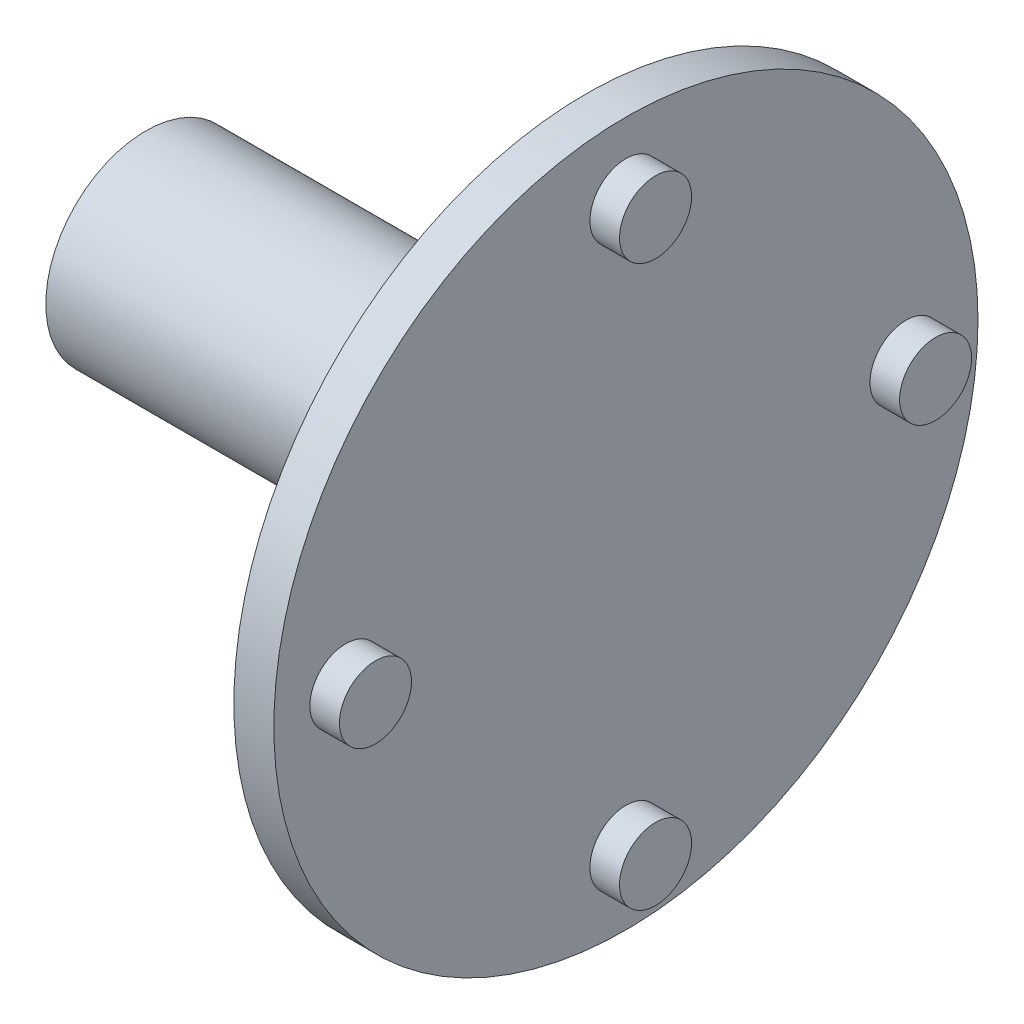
ISO-10303-21;
HEADER;
FILE_DESCRIPTION(('STEP AP214'),'2;1');
FILE_NAME('part.step','',(''),(''),'','','');
FILE_SCHEMA(('AUTOMOTIVE_DESIGN { 1 0 10303 214 1 1 1 1 }'));
ENDSEC;
DATA;
#1=APPLICATION_CONTEXT('core data for automotive mechanical design processes');
#2=APPLICATION_PROTOCOL_DEFINITION('international standard','automotive_design',2000,#1);
#3=PRODUCT_CONTEXT('',#1,'mechanical');
#4=PRODUCT('Part','Part','',(#3));
#5=PRODUCT_RELATED_PRODUCT_CATEGORY('part','',(#4));
#6=PRODUCT_DEFINITION_FORMATION('','',#4);
#7=PRODUCT_DEFINITION_CONTEXT('part definition',#1,'design');
#8=PRODUCT_DEFINITION('design','',#6,#7);
#9=PRODUCT_DEFINITION_SHAPE('','',#8);
#10=(LENGTH_UNIT() NAMED_UNIT(*) SI_UNIT(.MILLI.,.METRE.));
#11=(NAMED_UNIT(*) PLANE_ANGLE_UNIT() SI_UNIT($,.RADIAN.));
#12=(NAMED_UNIT(*) SI_UNIT($,.STERADIAN.) SOLID_ANGLE_UNIT());
#13=UNCERTAINTY_MEASURE_WITH_UNIT(LENGTH_MEASURE(1.E-05),#10,'distance_accuracy_value','');
#14=(GEOMETRIC_REPRESENTATION_CONTEXT(3) GLOBAL_UNCERTAINTY_ASSIGNED_CONTEXT((#13)) GLOBAL_UNIT_ASSIGNED_CONTEXT((#10,
#11,#12)) REPRESENTATION_CONTEXT('',''));
#15=CARTESIAN_POINT('',(0.,0.,0.));
#16=DIRECTION('',(0.,0.,1.));
#17=DIRECTION('',(1.,0.,0.));
#18=AXIS2_PLACEMENT_3D('',#15,#16,#17);
#19=CARTESIAN_POINT('',(2.,2.46546825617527E-13,35.));
#20=DIRECTION('',(-1.,0.,0.));
#21=DIRECTION('',(0.,0.,1.));
#22=AXIS2_PLACEMENT_3D('',#19,#20,#21);
#23=CYLINDRICAL_SURFACE('',#22,4.5);
#24=CARTESIAN_POINT('',(2.,2.46546825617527E-13,35.));
#25=DIRECTION('',(1.,0.,0.));
#26=DIRECTION('',(0.,0.,-1.));
#27=AXIS2_PLACEMENT_3D('',#24,#25,#26);
#28=CIRCLE('',#27,4.5);
#29=CARTESIAN_POINT('',(2.,2.46546825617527E-13,30.5));
#30=VERTEX_POINT('',#29);
#31=EDGE_CURVE('E50',#30,#30,#28,.T.);
#32=ORIENTED_EDGE('',*,*,#31,.F.);
#33=EDGE_LOOP('',(#32));
#34=FACE_BOUND('',#33,.T.);
#35=CARTESIAN_POINT('',(-2.,2.46546825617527E-13,35.));
#36=DIRECTION('',(1.,0.,0.));
#37=DIRECTION('',(0.,0.,-1.));
#38=AXIS2_PLACEMENT_3D('',#35,#36,#37);
#39=CIRCLE('',#38,4.5);
#40=CARTESIAN_POINT('',(-2.,2.46546825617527E-13,30.5));
#41=VERTEX_POINT('',#40);
#42=EDGE_CURVE('E11',#41,#41,#39,.T.);
#43=ORIENTED_EDGE('',*,*,#42,.T.);
#44=EDGE_LOOP('',(#43));
#45=FACE_BOUND('',#44,.T.);
#46=ADVANCED_FACE('F46',(#34,#45),#23,.T.);
#47=CARTESIAN_POINT('',(2.,2.46546825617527E-13,35.));
#48=DIRECTION('',(1.,0.,0.));
#49=DIRECTION('',(0.,0.,-1.));
#50=AXIS2_PLACEMENT_3D('',#47,#48,#49);
#51=PLANE('',#50);
#52=ORIENTED_EDGE('',*,*,#31,.T.);
#53=EDGE_LOOP('',(#52));
#54=FACE_BOUND('',#53,.T.);
#55=ADVANCED_FACE('F48',(#54),#51,.T.);
#56=CARTESIAN_POINT('',(-2.,2.46546825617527E-13,35.));
#57=DIRECTION('',(1.,0.,0.));
#58=DIRECTION('',(0.,0.,-1.));
#59=AXIS2_PLACEMENT_3D('',#56,#57,#58);
#60=PLANE('',#59);
#61=ORIENTED_EDGE('',*,*,#42,.F.);
#62=EDGE_LOOP('',(#61));
#63=FACE_BOUND('',#62,.T.);
#64=ADVANCED_FACE('F65',(#63),#60,.F.);
#65=CLOSED_SHELL('',(#46,#55,#64));
#66=MANIFOLD_SOLID_BREP('B2',#65);
#67=CARTESIAN_POINT('',(2.,-35.,1.24344978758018E-13));
#68=DIRECTION('',(-1.,0.,0.));
#69=DIRECTION('',(0.,0.,1.));
#70=AXIS2_PLACEMENT_3D('',#67,#68,#69);
#71=CYLINDRICAL_SURFACE('',#70,4.5);
#72=CARTESIAN_POINT('',(2.,-35.,1.24344978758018E-13));
#73=DIRECTION('',(1.,0.,0.));
#74=DIRECTION('',(0.,0.,-1.));
#75=AXIS2_PLACEMENT_3D('',#72,#73,#74);
#76=CIRCLE('',#75,4.5);
#77=CARTESIAN_POINT('',(2.,-35.,-4.49999999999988));
#78=VERTEX_POINT('',#77);
#79=EDGE_CURVE('E99',#78,#78,#76,.T.);
#80=ORIENTED_EDGE('',*,*,#79,.F.);
#81=EDGE_LOOP('',(#80));
#82=FACE_BOUND('',#81,.T.);
#83=CARTESIAN_POINT('',(-2.,-35.,1.24344978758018E-13));
#84=DIRECTION('',(1.,0.,0.));
#85=DIRECTION('',(0.,0.,-1.));
#86=AXIS2_PLACEMENT_3D('',#83,#84,#85);
#87=CIRCLE('',#86,4.5);
#88=CARTESIAN_POINT('',(-2.,-35.,-4.49999999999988));
#89=VERTEX_POINT('',#88);
#90=EDGE_CURVE('E45',#89,#89,#87,.T.);
#91=ORIENTED_EDGE('',*,*,#90,.T.);
#92=EDGE_LOOP('',(#91));
#93=FACE_BOUND('',#92,.T.);
#94=ADVANCED_FACE('F95',(#82,#93),#71,.T.);
#95=CARTESIAN_POINT('',(2.,-35.,1.24344978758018E-13));
#96=DIRECTION('',(1.,0.,0.));
#97=DIRECTION('',(0.,0.,-1.));
#98=AXIS2_PLACEMENT_3D('',#95,#96,#97);
#99=PLANE('',#98);
#100=ORIENTED_EDGE('',*,*,#79,.T.);
#101=EDGE_LOOP('',(#100));
#102=FACE_BOUND('',#101,.T.);
#103=ADVANCED_FACE('F97',(#102),#99,.T.);
#104=CARTESIAN_POINT('',(-2.,-35.,1.24344978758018E-13));
#105=DIRECTION('',(1.,0.,0.));
#106=DIRECTION('',(0.,0.,-1.));
#107=AXIS2_PLACEMENT_3D('',#104,#105,#106);
#108=PLANE('',#107);
#109=ORIENTED_EDGE('',*,*,#90,.F.);
#110=EDGE_LOOP('',(#109));
#111=FACE_BOUND('',#110,.T.);
#112=ADVANCED_FACE('F114',(#111),#108,.F.);
#113=CLOSED_SHELL('',(#94,#103,#112));
#114=MANIFOLD_SOLID_BREP('B6',#113);
#115=CARTESIAN_POINT('',(2.,0.,-35.));
#116=DIRECTION('',(-1.,0.,0.));
#117=DIRECTION('',(0.,0.,1.));
#118=AXIS2_PLACEMENT_3D('',#115,#116,#117);
#119=CYLINDRICAL_SURFACE('',#118,4.49999999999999);
#120=CARTESIAN_POINT('',(2.,0.,-35.));
#121=DIRECTION('',(1.,0.,0.));
#122=DIRECTION('',(0.,0.,-1.));
#123=AXIS2_PLACEMENT_3D('',#120,#121,#122);
#124=CIRCLE('',#123,4.49999999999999);
#125=CARTESIAN_POINT('',(2.,0.,-39.5));
#126=VERTEX_POINT('',#125);
#127=EDGE_CURVE('E148',#126,#126,#124,.T.);
#128=ORIENTED_EDGE('',*,*,#127,.F.);
#129=EDGE_LOOP('',(#128));
#130=FACE_BOUND('',#129,.T.);
#131=CARTESIAN_POINT('',(-2.,0.,-35.));
#132=DIRECTION('',(1.,0.,0.));
#133=DIRECTION('',(0.,0.,-1.));
#134=AXIS2_PLACEMENT_3D('',#131,#132,#133);
#135=CIRCLE('',#134,4.49999999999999);
#136=CARTESIAN_POINT('',(-2.,0.,-39.5));
#137=VERTEX_POINT('',#136);
#138=EDGE_CURVE('E94',#137,#137,#135,.T.);
#139=ORIENTED_EDGE('',*,*,#138,.T.);
#140=EDGE_LOOP('',(#139));
#141=FACE_BOUND('',#140,.T.);
#142=ADVANCED_FACE('F144',(#130,#141),#119,.T.);
#143=CARTESIAN_POINT('',(2.,0.,-35.));
#144=DIRECTION('',(1.,0.,0.));
#145=DIRECTION('',(0.,0.,-1.));
#146=AXIS2_PLACEMENT_3D('',#143,#144,#145);
#147=PLANE('',#146);
#148=ORIENTED_EDGE('',*,*,#127,.T.);
#149=EDGE_LOOP('',(#148));
#150=FACE_BOUND('',#149,.T.);
#151=ADVANCED_FACE('F146',(#150),#147,.T.);
#152=CARTESIAN_POINT('',(-2.,0.,-35.));
#153=DIRECTION('',(1.,0.,0.));
#154=DIRECTION('',(0.,0.,-1.));
#155=AXIS2_PLACEMENT_3D('',#152,#153,#154);
#156=PLANE('',#155);
#157=ORIENTED_EDGE('',*,*,#138,.F.);
#158=EDGE_LOOP('',(#157));
#159=FACE_BOUND('',#158,.T.);
#160=ADVANCED_FACE('F163',(#159),#156,.F.);
#161=CLOSED_SHELL('',(#142,#151,#160));
#162=MANIFOLD_SOLID_BREP('B40',#161);
#163=CARTESIAN_POINT('',(2.,35.,1.20058714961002E-13));
#164=DIRECTION('',(-1.,0.,0.));
#165=DIRECTION('',(0.,0.,1.));
#166=AXIS2_PLACEMENT_3D('',#163,#164,#165);
#167=CYLINDRICAL_SURFACE('',#166,4.5);
#168=CARTESIAN_POINT('',(2.,35.,1.20058714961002E-13));
#169=DIRECTION('',(1.,0.,0.));
#170=DIRECTION('',(0.,0.,-1.));
#171=AXIS2_PLACEMENT_3D('',#168,#169,#170);
#172=CIRCLE('',#171,4.5);
#173=CARTESIAN_POINT('',(2.,35.,-4.49999999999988));
#174=VERTEX_POINT('',#173);
#175=EDGE_CURVE('E143',#174,#174,#172,.T.);
#176=ORIENTED_EDGE('',*,*,#175,.F.);
#177=EDGE_LOOP('',(#176));
#178=FACE_BOUND('',#177,.T.);
#179=CARTESIAN_POINT('',(-2.,35.,1.20058714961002E-13));
#180=DIRECTION('',(1.,0.,0.));
#181=DIRECTION('',(0.,0.,-1.));
#182=AXIS2_PLACEMENT_3D('',#179,#180,#181);
#183=CIRCLE('',#182,4.5);
#184=CARTESIAN_POINT('',(-2.,35.,-4.49999999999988));
#185=VERTEX_POINT('',#184);
#186=EDGE_CURVE('E195',#185,#185,#183,.T.);
#187=ORIENTED_EDGE('',*,*,#186,.T.);
#188=EDGE_LOOP('',(#187));
#189=FACE_BOUND('',#188,.T.);
#190=ADVANCED_FACE('F192',(#178,#189),#167,.T.);
#191=CARTESIAN_POINT('',(2.,35.,1.20058714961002E-13));
#192=DIRECTION('',(1.,0.,0.));
#193=DIRECTION('',(0.,0.,-1.));
#194=AXIS2_PLACEMENT_3D('',#191,#192,#193);
#195=PLANE('',#194);
#196=ORIENTED_EDGE('',*,*,#175,.T.);
#197=EDGE_LOOP('',(#196));
#198=FACE_BOUND('',#197,.T.);
#199=ADVANCED_FACE('F207',(#198),#195,.T.);
#200=CARTESIAN_POINT('',(-2.,35.,1.20058714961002E-13));
#201=DIRECTION('',(1.,0.,0.));
#202=DIRECTION('',(0.,0.,-1.));
#203=AXIS2_PLACEMENT_3D('',#200,#201,#202);
#204=PLANE('',#203);
#205=ORIENTED_EDGE('',*,*,#186,.F.);
#206=EDGE_LOOP('',(#205));
#207=FACE_BOUND('',#206,.T.);
#208=ADVANCED_FACE('F205',(#207),#204,.F.);
#209=CLOSED_SHELL('',(#190,#199,#208));
#210=MANIFOLD_SOLID_BREP('B89',#209);
#211=CARTESIAN_POINT('',(-61.7,0.,0.));
#212=DIRECTION('',(1.,0.,0.));
#213=DIRECTION('',(0.,0.,-1.));
#214=AXIS2_PLACEMENT_3D('',#211,#212,#213);
#215=CYLINDRICAL_SURFACE('',#214,12.5);
#216=CARTESIAN_POINT('',(-61.7,0.,0.));
#217=DIRECTION('',(1.,0.,0.));
#218=DIRECTION('',(0.,0.,-1.));
#219=AXIS2_PLACEMENT_3D('',#216,#217,#218);
#220=CIRCLE('',#219,12.5);
#221=CARTESIAN_POINT('',(-61.7,0.,-12.5));
#222=VERTEX_POINT('',#221);
#223=EDGE_CURVE('E191',#222,#222,#220,.T.);
#224=ORIENTED_EDGE('',*,*,#223,.T.);
#225=EDGE_LOOP('',(#224));
#226=FACE_BOUND('',#225,.T.);
#227=CARTESIAN_POINT('',(-6.7,0.,0.));
#228=DIRECTION('',(1.,0.,0.));
#229=DIRECTION('',(0.,0.,-1.));
#230=AXIS2_PLACEMENT_3D('',#227,#228,#229);
#231=CIRCLE('',#230,12.5);
#232=CARTESIAN_POINT('',(-6.7,0.,-12.5));
#233=VERTEX_POINT('',#232);
#234=EDGE_CURVE('E236',#233,#233,#231,.F.);
#235=ORIENTED_EDGE('',*,*,#234,.T.);
#236=EDGE_LOOP('',(#235));
#237=FACE_BOUND('',#236,.T.);
#238=ADVANCED_FACE('F233',(#226,#237),#215,.T.);
#239=CARTESIAN_POINT('',(-61.7,0.,0.));
#240=DIRECTION('',(1.,0.,0.));
#241=DIRECTION('',(0.,0.,-1.));
#242=AXIS2_PLACEMENT_3D('',#239,#240,#241);
#243=PLANE('',#242);
#244=ORIENTED_EDGE('',*,*,#223,.F.);
#245=EDGE_LOOP('',(#244));
#246=FACE_BOUND('',#245,.T.);
#247=ADVANCED_FACE('F264',(#246),#243,.F.);
#248=CARTESIAN_POINT('',(-6.7,0.,0.));
#249=DIRECTION('',(1.,0.,0.));
#250=DIRECTION('',(0.,0.,-1.));
#251=AXIS2_PLACEMENT_3D('',#248,#249,#250);
#252=CYLINDRICAL_SURFACE('',#251,44.);
#253=CARTESIAN_POINT('',(-6.7,0.,0.));
#254=DIRECTION('',(1.,0.,0.));
#255=DIRECTION('',(0.,0.,-1.));
#256=AXIS2_PLACEMENT_3D('',#253,#254,#255);
#257=CIRCLE('',#256,44.);
#258=CARTESIAN_POINT('',(-6.7,0.,-44.));
#259=VERTEX_POINT('',#258);
#260=EDGE_CURVE('E243',#259,#259,#257,.T.);
#261=ORIENTED_EDGE('',*,*,#260,.T.);
#262=EDGE_LOOP('',(#261));
#263=FACE_BOUND('',#262,.T.);
#264=CARTESIAN_POINT('',(-1.7,0.,0.));
#265=DIRECTION('',(1.,0.,0.));
#266=DIRECTION('',(0.,0.,-1.));
#267=AXIS2_PLACEMENT_3D('',#264,#265,#266);
#268=CIRCLE('',#267,44.);
#269=CARTESIAN_POINT('',(-1.7,0.,-44.));
#270=VERTEX_POINT('',#269);
#271=EDGE_CURVE('E245',#270,#270,#268,.T.);
#272=ORIENTED_EDGE('',*,*,#271,.F.);
#273=EDGE_LOOP('',(#272));
#274=FACE_BOUND('',#273,.T.);
#275=ADVANCED_FACE('F251',(#263,#274),#252,.T.);
#276=CARTESIAN_POINT('',(-6.7,0.,0.));
#277=DIRECTION('',(1.,0.,0.));
#278=DIRECTION('',(0.,0.,-1.));
#279=AXIS2_PLACEMENT_3D('',#276,#277,#278);
#280=PLANE('',#279);
#281=ORIENTED_EDGE('',*,*,#234,.F.);
#282=EDGE_LOOP('',(#281));
#283=FACE_BOUND('',#282,.T.);
#284=ORIENTED_EDGE('',*,*,#260,.F.);
#285=EDGE_LOOP('',(#284));
#286=FACE_BOUND('',#285,.T.);
#287=ADVANCED_FACE('F254',(#283,#286),#280,.F.);
#288=CARTESIAN_POINT('',(-1.7,0.,0.));
#289=DIRECTION('',(1.,0.,0.));
#290=DIRECTION('',(0.,0.,-1.));
#291=AXIS2_PLACEMENT_3D('',#288,#289,#290);
#292=PLANE('',#291);
#293=ORIENTED_EDGE('',*,*,#271,.T.);
#294=EDGE_LOOP('',(#293));
#295=FACE_BOUND('',#294,.T.);
#296=ADVANCED_FACE('F256',(#295),#292,.T.);
#297=CLOSED_SHELL('',(#238,#247,#275,#287,#296));
#298=MANIFOLD_SOLID_BREP('B138',#297);
#299=ADVANCED_BREP_SHAPE_REPRESENTATION('',(#18,#66,#114,#162,#210,#298),#14);
#300=SHAPE_DEFINITION_REPRESENTATION(#9,#299);
ENDSEC;
END-ISO-10303-21;
